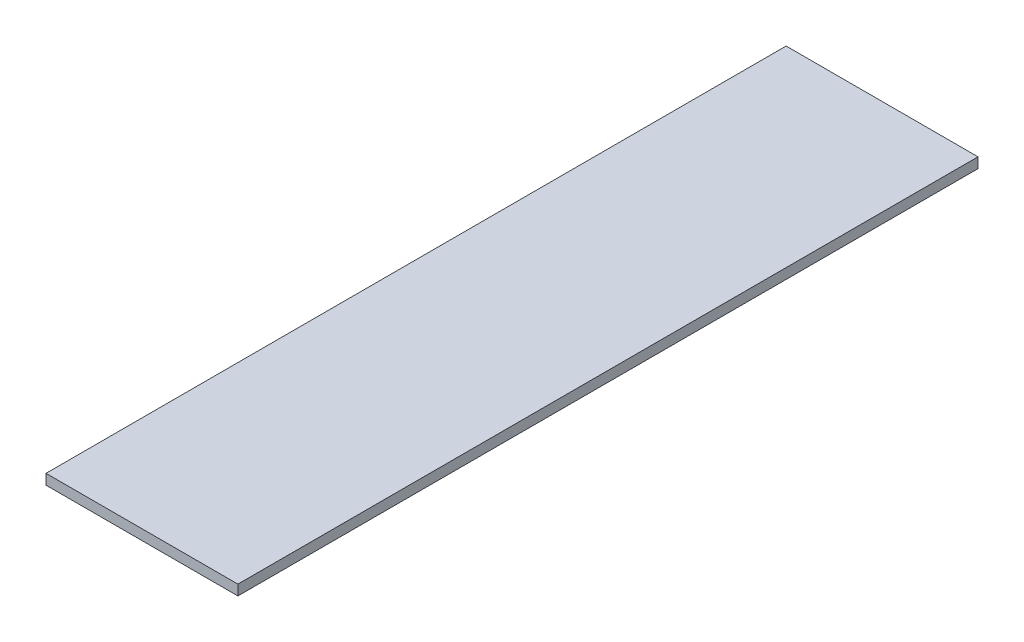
from build123d import *

# Parameters (mm, degrees)
SKETCH1_W           = 88.9
SKETCH1_H           = 342.9
BOSS_EXTRUDE1_DEPTH = 4.7625


with BuildPart() as part:
    # Sketch1 → Boss-Extrude1 (new body)
    with BuildSketch(Plane(origin=(0, 0, 0), x_dir=(1, 0, 0), z_dir=(0, 1, 0))):
        Rectangle(SKETCH1_W, SKETCH1_H)
    extrude(amount=BOSS_EXTRUDE1_DEPTH)


solid = part.part
